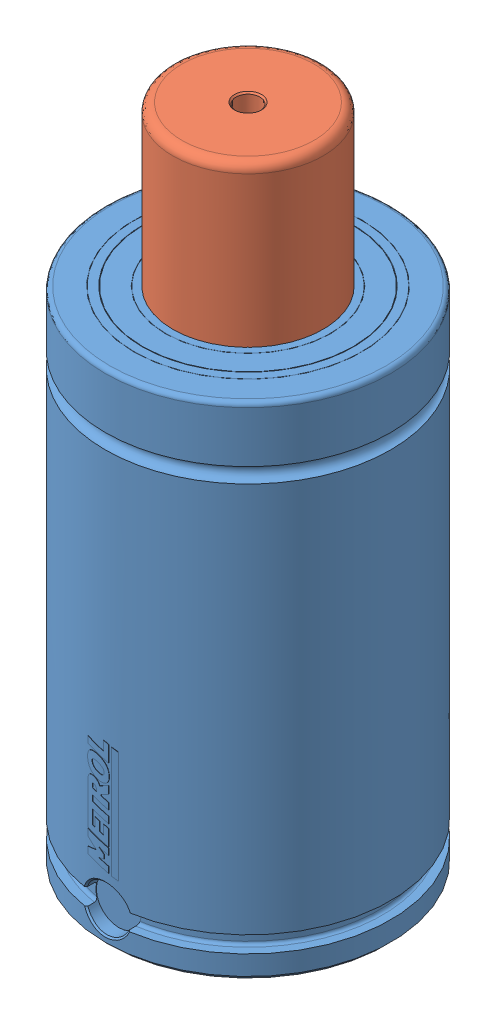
SolidWorks assembly ISNG3000-050.SLDASM, configuration Default (file format 7000). Lengths in mm.
Overall size (95 220 95.11).
2 component instances, 2 part files, 5 mates.
Components (placement in the parent):
- ISNG-3000 Body-1: ISNG-3000 Body.SLDPRT [ISNG-3000-50] x (0 0 1) z (0 -1 0) size (95.11 95 167)
- ISNG-3000 Piston-1: ISNG-3000 Piston.SLDPRT [ISNG-3000-50] at (0 142 0) x (0.92691 0 0.375284) z (0 -1 0) size (60 60 78)
Mates (geometry in assembly coordinates):
- Concentric1: concentric aligned: cylinder of ISNG-3000 Body-1 through (0 0 0) axis (0 -1 0) radius 25; cylinder of ISNG-3000 Piston-1 through (0 142 0) axis (0 -1 0) radius 25
- LimitDistance1: limit distance anti-aligned: plane of ISNG-3000 Piston-1 through (-11.2585 147 27.8073) normal (0 1 0); plane of ISNG-3000 Body-1 through (-25 147 0) normal (0 -1 0)
- Coincident2: coincident anti-aligned: plane of ISNG-3000 Body-1 through (0 0 0) normal (0 -1 0); plane of assembly through (0 0 0) normal (0 1 0)
- Coincident3: coincident anti-aligned: plane of ISNG-3000 Body-1; plane of assembly through (0 0 0) normal (1 0 0)
- Coincident4: coincident aligned: plane of ISNG-3000 Body-1; plane of assembly through (0 0 0) normal (0 0 1)
